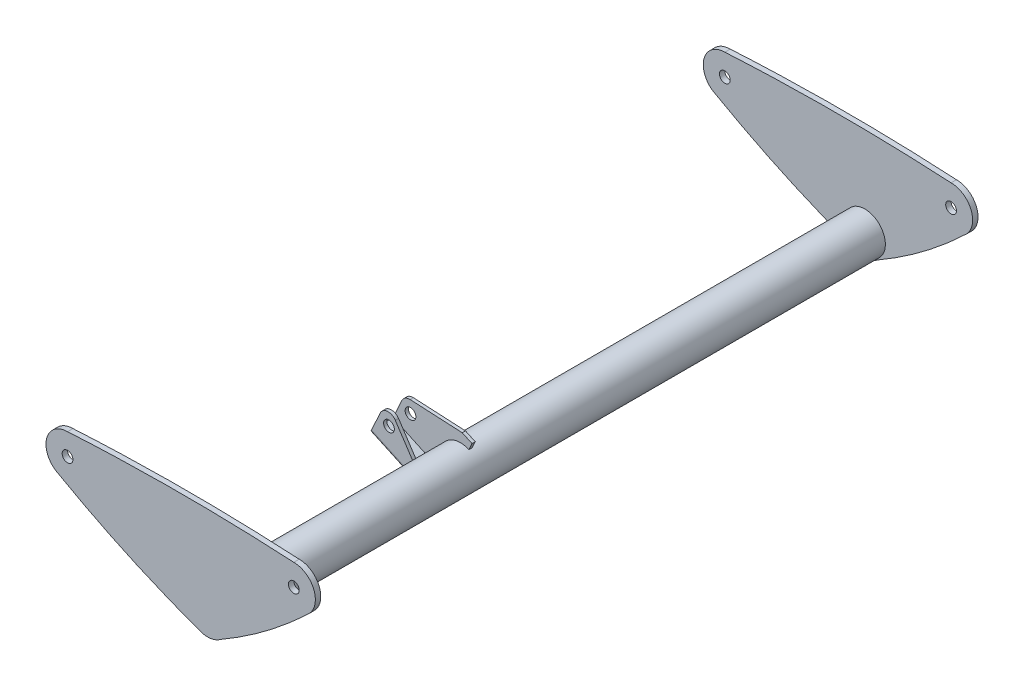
ISO-10303-21;
HEADER;
FILE_DESCRIPTION(('STEP AP214'),'2;1');
FILE_NAME('part.step','',(''),(''),'','','');
FILE_SCHEMA(('AUTOMOTIVE_DESIGN { 1 0 10303 214 1 1 1 1 }'));
ENDSEC;
DATA;
#1=APPLICATION_CONTEXT('core data for automotive mechanical design processes');
#2=APPLICATION_PROTOCOL_DEFINITION('international standard','automotive_design',2000,#1);
#3=PRODUCT_CONTEXT('',#1,'mechanical');
#4=PRODUCT('Part','Part','',(#3));
#5=PRODUCT_RELATED_PRODUCT_CATEGORY('part','',(#4));
#6=PRODUCT_DEFINITION_FORMATION('','',#4);
#7=PRODUCT_DEFINITION_CONTEXT('part definition',#1,'design');
#8=PRODUCT_DEFINITION('design','',#6,#7);
#9=PRODUCT_DEFINITION_SHAPE('','',#8);
#10=(LENGTH_UNIT() NAMED_UNIT(*) SI_UNIT(.MILLI.,.METRE.));
#11=(NAMED_UNIT(*) PLANE_ANGLE_UNIT() SI_UNIT($,.RADIAN.));
#12=(NAMED_UNIT(*) SI_UNIT($,.STERADIAN.) SOLID_ANGLE_UNIT());
#13=UNCERTAINTY_MEASURE_WITH_UNIT(LENGTH_MEASURE(1.E-05),#10,'distance_accuracy_value','');
#14=(GEOMETRIC_REPRESENTATION_CONTEXT(3) GLOBAL_UNCERTAINTY_ASSIGNED_CONTEXT((#13)) GLOBAL_UNIT_ASSIGNED_CONTEXT((#10,
#11,#12)) REPRESENTATION_CONTEXT('',''));
#15=CARTESIAN_POINT('',(0.,0.,0.));
#16=DIRECTION('',(0.,0.,1.));
#17=DIRECTION('',(1.,0.,0.));
#18=AXIS2_PLACEMENT_3D('',#15,#16,#17);
#19=CARTESIAN_POINT('',(122.037894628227,-77.2512283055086,-232.5));
#20=DIRECTION('',(0.419058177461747,0.907959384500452,0.));
#21=DIRECTION('',(-0.907959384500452,0.419058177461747,0.));
#22=AXIS2_PLACEMENT_3D('',#19,#20,#21);
#23=PLANE('',#22);
#24=DIRECTION('',(0.,0.,1.));
#25=VECTOR('',#24,1.);
#26=CARTESIAN_POINT('',(121.129935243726,-76.8321701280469,-212.5));
#27=LINE('',#26,#25);
#28=CARTESIAN_POINT('',(121.129935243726,-76.8321701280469,-232.5));
#29=VERTEX_POINT('',#28);
#30=CARTESIAN_POINT('',(121.129935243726,-76.8321701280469,-229.5));
#31=VERTEX_POINT('',#30);
#32=EDGE_CURVE('E63',#29,#31,#27,.T.);
#33=ORIENTED_EDGE('',*,*,#32,.F.);
#34=DIRECTION('',(-0.907959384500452,0.419058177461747,0.));
#35=VECTOR('',#34,1.);
#36=CARTESIAN_POINT('',(122.037894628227,-77.2512283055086,-232.5));
#37=LINE('',#36,#35);
#38=CARTESIAN_POINT('',(122.037894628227,-77.2512283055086,-232.5));
#39=VERTEX_POINT('',#38);
#40=EDGE_CURVE('E321',#39,#29,#37,.T.);
#41=ORIENTED_EDGE('',*,*,#40,.F.);
#42=DIRECTION('',(0.,0.,1.));
#43=VECTOR('',#42,1.);
#44=CARTESIAN_POINT('',(122.037894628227,-77.2512283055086,-232.5));
#45=LINE('',#44,#43);
#46=CARTESIAN_POINT('',(122.037894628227,-77.2512283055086,-229.5));
#47=VERTEX_POINT('',#46);
#48=EDGE_CURVE('E342',#39,#47,#45,.T.);
#49=ORIENTED_EDGE('',*,*,#48,.T.);
#50=DIRECTION('',(-0.907959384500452,0.419058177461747,0.));
#51=VECTOR('',#50,1.);
#52=CARTESIAN_POINT('',(122.037894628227,-77.2512283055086,-229.5));
#53=LINE('',#52,#51);
#54=EDGE_CURVE('E337',#47,#31,#53,.T.);
#55=ORIENTED_EDGE('',*,*,#54,.T.);
#56=EDGE_LOOP('',(#33,#41,#49,#55));
#57=FACE_BOUND('',#56,.T.);
#58=ADVANCED_FACE('F45',(#57),#23,.F.);
#59=CARTESIAN_POINT('',(122.037894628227,-77.2512283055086,-209.5));
#60=DIRECTION('',(-0.419058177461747,-0.907959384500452,0.));
#61=DIRECTION('',(0.907959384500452,-0.419058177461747,0.));
#62=AXIS2_PLACEMENT_3D('',#59,#60,#61);
#63=PLANE('',#62);
#64=DIRECTION('',(-0.907959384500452,0.419058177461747,0.));
#65=VECTOR('',#64,1.);
#66=CARTESIAN_POINT('',(122.037894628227,-77.2512283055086,-209.5));
#67=LINE('',#66,#65);
#68=CARTESIAN_POINT('',(122.037894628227,-77.2512283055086,-209.5));
#69=VERTEX_POINT('',#68);
#70=CARTESIAN_POINT('',(121.129935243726,-76.8321701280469,-209.5));
#71=VERTEX_POINT('',#70);
#72=EDGE_CURVE('E262',#69,#71,#67,.T.);
#73=ORIENTED_EDGE('',*,*,#72,.T.);
#74=CARTESIAN_POINT('',(121.129935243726,-76.8321701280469,-212.5));
#75=VERTEX_POINT('',#74);
#76=EDGE_CURVE('E236',#75,#71,#27,.T.);
#77=ORIENTED_EDGE('',*,*,#76,.F.);
#78=DIRECTION('',(-0.907959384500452,0.419058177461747,0.));
#79=VECTOR('',#78,1.);
#80=CARTESIAN_POINT('',(122.037894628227,-77.2512283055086,-212.5));
#81=LINE('',#80,#79);
#82=CARTESIAN_POINT('',(122.037894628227,-77.2512283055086,-212.5));
#83=VERTEX_POINT('',#82);
#84=EDGE_CURVE('E289',#83,#75,#81,.T.);
#85=ORIENTED_EDGE('',*,*,#84,.F.);
#86=DIRECTION('',(0.,0.,-1.));
#87=VECTOR('',#86,1.);
#88=CARTESIAN_POINT('',(122.037894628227,-77.2512283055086,-209.5));
#89=LINE('',#88,#87);
#90=EDGE_CURVE('E272',#69,#83,#89,.T.);
#91=ORIENTED_EDGE('',*,*,#90,.F.);
#92=EDGE_LOOP('',(#73,#77,#85,#91));
#93=FACE_BOUND('',#92,.T.);
#94=ADVANCED_FACE('F270',(#93),#63,.T.);
#95=CARTESIAN_POINT('',(130.,-60.,-605.));
#96=DIRECTION('',(0.,0.,1.));
#97=DIRECTION('',(1.,0.,0.));
#98=AXIS2_PLACEMENT_3D('',#95,#96,#97);
#99=CYLINDRICAL_SURFACE('',#98,19.);
#100=CARTESIAN_POINT('',(130.,-60.,0.));
#101=DIRECTION('',(0.,0.,1.));
#102=DIRECTION('',(1.,0.,0.));
#103=AXIS2_PLACEMENT_3D('',#100,#101,#102);
#104=CIRCLE('',#103,19.);
#105=CARTESIAN_POINT('',(149.,-60.,0.));
#106=VERTEX_POINT('',#105);
#107=EDGE_CURVE('E12',#106,#106,#104,.F.);
#108=ORIENTED_EDGE('',*,*,#107,.T.);
#109=EDGE_LOOP('',(#108));
#110=FACE_BOUND('',#109,.T.);
#111=CARTESIAN_POINT('',(130.,-60.,-605.));
#112=DIRECTION('',(0.,0.,-1.));
#113=DIRECTION('',(-1.,0.,0.));
#114=AXIS2_PLACEMENT_3D('',#111,#112,#113);
#115=CIRCLE('',#114,19.);
#116=CARTESIAN_POINT('',(111.,-60.,-605.));
#117=VERTEX_POINT('',#116);
#118=EDGE_CURVE('E639',#117,#117,#115,.T.);
#119=ORIENTED_EDGE('',*,*,#118,.F.);
#120=EDGE_LOOP('',(#119));
#121=FACE_BOUND('',#120,.T.);
#122=ORIENTED_EDGE('',*,*,#48,.F.);
#123=CARTESIAN_POINT('',(130.,-60.,-232.5));
#124=DIRECTION('',(0.,0.,1.));
#125=DIRECTION('',(-1.,0.,0.));
#126=AXIS2_PLACEMENT_3D('',#123,#124,#125);
#127=CIRCLE('',#126,19.);
#128=CARTESIAN_POINT('',(137.962105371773,-42.7487716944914,-232.5));
#129=VERTEX_POINT('',#128);
#130=EDGE_CURVE('E318',#129,#39,#127,.T.);
#131=ORIENTED_EDGE('',*,*,#130,.F.);
#132=DIRECTION('',(0.,0.,1.));
#133=VECTOR('',#132,1.);
#134=CARTESIAN_POINT('',(137.962105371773,-42.7487716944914,-232.5));
#135=LINE('',#134,#133);
#136=CARTESIAN_POINT('',(137.962105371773,-42.7487716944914,-229.5));
#137=VERTEX_POINT('',#136);
#138=EDGE_CURVE('E345',#129,#137,#135,.T.);
#139=ORIENTED_EDGE('',*,*,#138,.T.);
#140=CARTESIAN_POINT('',(130.,-60.,-229.5));
#141=DIRECTION('',(0.,0.,1.));
#142=DIRECTION('',(-1.,0.,0.));
#143=AXIS2_PLACEMENT_3D('',#140,#141,#142);
#144=CIRCLE('',#143,19.);
#145=EDGE_CURVE('E335',#137,#47,#144,.T.);
#146=ORIENTED_EDGE('',*,*,#145,.T.);
#147=EDGE_LOOP('',(#122,#131,#139,#146));
#148=FACE_BOUND('',#147,.T.);
#149=CARTESIAN_POINT('',(130.,-60.,-209.5));
#150=DIRECTION('',(0.,0.,1.));
#151=DIRECTION('',(-1.,0.,0.));
#152=AXIS2_PLACEMENT_3D('',#149,#150,#151);
#153=CIRCLE('',#152,19.);
#154=CARTESIAN_POINT('',(113.125592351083,-68.7323746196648,-209.5));
#155=VERTEX_POINT('',#154);
#156=EDGE_CURVE('E286',#155,#69,#153,.T.);
#157=ORIENTED_EDGE('',*,*,#156,.T.);
#158=ORIENTED_EDGE('',*,*,#90,.T.);
#159=CARTESIAN_POINT('',(130.,-60.,-212.5));
#160=DIRECTION('',(0.,0.,1.));
#161=DIRECTION('',(-1.,0.,0.));
#162=AXIS2_PLACEMENT_3D('',#159,#160,#161);
#163=CIRCLE('',#162,19.);
#164=CARTESIAN_POINT('',(113.125592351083,-68.7323746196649,-212.5));
#165=VERTEX_POINT('',#164);
#166=EDGE_CURVE('E273',#165,#83,#163,.T.);
#167=ORIENTED_EDGE('',*,*,#166,.F.);
#168=DIRECTION('',(0.,0.,-1.));
#169=VECTOR('',#168,1.);
#170=CARTESIAN_POINT('',(113.125592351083,-68.7323746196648,-209.5));
#171=LINE('',#170,#169);
#172=EDGE_CURVE('E301',#155,#165,#171,.T.);
#173=ORIENTED_EDGE('',*,*,#172,.F.);
#174=EDGE_LOOP('',(#157,#158,#167,#173));
#175=FACE_BOUND('',#174,.T.);
#176=ADVANCED_FACE('F397',(#110,#121,#148,#175),#99,.T.);
#177=CARTESIAN_POINT('',(105.,23.,0.));
#178=DIRECTION('',(0.,0.,1.));
#179=DIRECTION('',(1.,0.,0.));
#180=AXIS2_PLACEMENT_3D('',#177,#178,#179);
#181=PLANE('',#180);
#182=CARTESIAN_POINT('',(0.,0.,0.));
#183=DIRECTION('',(0.,0.,1.));
#184=DIRECTION('',(1.,0.,0.));
#185=AXIS2_PLACEMENT_3D('',#182,#183,#184);
#186=CIRCLE('',#185,5.);
#187=CARTESIAN_POINT('',(5.,0.,0.));
#188=VERTEX_POINT('',#187);
#189=EDGE_CURVE('E646',#188,#188,#186,.T.);
#190=ORIENTED_EDGE('',*,*,#189,.T.);
#191=EDGE_LOOP('',(#190));
#192=FACE_BOUND('',#191,.T.);
#193=CARTESIAN_POINT('',(210.,20.,0.));
#194=CARTESIAN_POINT('',(105.,26.,0.));
#195=CARTESIAN_POINT('',(0.,20.,0.));
#196=B_SPLINE_CURVE_WITH_KNOTS('',2,(#193,#194,#195),.UNSPECIFIED.,.F.,.F.,(3,3),(0.,1.),.UNSPECIFIED.);
#197=CARTESIAN_POINT('',(210.,20.,0.));
#198=VERTEX_POINT('',#197);
#199=CARTESIAN_POINT('',(0.,20.,0.));
#200=VERTEX_POINT('',#199);
#201=EDGE_CURVE('E442',#198,#200,#196,.T.);
#202=ORIENTED_EDGE('',*,*,#201,.F.);
#203=CARTESIAN_POINT('',(210.,0.,0.));
#204=DIRECTION('',(0.,0.,1.));
#205=DIRECTION('',(1.,0.,0.));
#206=AXIS2_PLACEMENT_3D('',#203,#204,#205);
#207=CIRCLE('',#206,20.);
#208=CARTESIAN_POINT('',(222.,-16.,0.));
#209=VERTEX_POINT('',#208);
#210=EDGE_CURVE('E466',#209,#198,#207,.T.);
#211=ORIENTED_EDGE('',*,*,#210,.F.);
#212=CARTESIAN_POINT('',(142.,-76.,0.));
#213=CARTESIAN_POINT('',(185.6,-50.8,0.));
#214=CARTESIAN_POINT('',(222.,-16.,0.));
#215=B_SPLINE_CURVE_WITH_KNOTS('',2,(#212,#213,#214),.UNSPECIFIED.,.F.,.F.,(3,3),(0.,1.),.UNSPECIFIED.);
#216=CARTESIAN_POINT('',(142.,-76.,0.));
#217=VERTEX_POINT('',#216);
#218=EDGE_CURVE('E462',#217,#209,#215,.T.);
#219=ORIENTED_EDGE('',*,*,#218,.F.);
#220=CARTESIAN_POINT('',(130.,-60.,0.));
#221=DIRECTION('',(0.,0.,1.));
#222=DIRECTION('',(1.,0.,0.));
#223=AXIS2_PLACEMENT_3D('',#220,#221,#222);
#224=CIRCLE('',#223,20.);
#225=CARTESIAN_POINT('',(121.618836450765,-78.159187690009,0.));
#226=VERTEX_POINT('',#225);
#227=EDGE_CURVE('E457',#226,#217,#224,.T.);
#228=ORIENTED_EDGE('',*,*,#227,.F.);
#229=CARTESIAN_POINT('',(-8.38116354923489,-18.159187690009,0.));
#230=CARTESIAN_POINT('',(54.1044873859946,-53.6069439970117,0.));
#231=CARTESIAN_POINT('',(121.618836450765,-78.159187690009,0.));
#232=B_SPLINE_CURVE_WITH_KNOTS('',2,(#229,#230,#231),.UNSPECIFIED.,.F.,.F.,(3,3),(0.,1.),.UNSPECIFIED.);
#233=CARTESIAN_POINT('',(-8.38116354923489,-18.159187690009,0.));
#234=VERTEX_POINT('',#233);
#235=EDGE_CURVE('E453',#234,#226,#232,.T.);
#236=ORIENTED_EDGE('',*,*,#235,.F.);
#237=CARTESIAN_POINT('',(0.,0.,0.));
#238=DIRECTION('',(0.,0.,1.));
#239=DIRECTION('',(1.,0.,0.));
#240=AXIS2_PLACEMENT_3D('',#237,#238,#239);
#241=CIRCLE('',#240,20.);
#242=EDGE_CURVE('E447',#200,#234,#241,.T.);
#243=ORIENTED_EDGE('',*,*,#242,.F.);
#244=EDGE_LOOP('',(#202,#211,#219,#228,#236,#243));
#245=FACE_BOUND('',#244,.T.);
#246=CARTESIAN_POINT('',(210.,0.,0.));
#247=DIRECTION('',(0.,0.,1.));
#248=DIRECTION('',(1.,0.,0.));
#249=AXIS2_PLACEMENT_3D('',#246,#247,#248);
#250=CIRCLE('',#249,5.00000000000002);
#251=CARTESIAN_POINT('',(215.,0.,0.));
#252=VERTEX_POINT('',#251);
#253=EDGE_CURVE('E642',#252,#252,#250,.T.);
#254=ORIENTED_EDGE('',*,*,#253,.T.);
#255=EDGE_LOOP('',(#254));
#256=FACE_BOUND('',#255,.T.);
#257=ORIENTED_EDGE('',*,*,#107,.F.);
#258=EDGE_LOOP('',(#257));
#259=FACE_BOUND('',#258,.T.);
#260=ADVANCED_FACE('F400',(#192,#245,#256,#259),#181,.F.);
#261=CARTESIAN_POINT('',(105.,23.,5.));
#262=DIRECTION('',(0.,0.,1.));
#263=DIRECTION('',(1.,0.,0.));
#264=AXIS2_PLACEMENT_3D('',#261,#262,#263);
#265=PLANE('',#264);
#266=CARTESIAN_POINT('',(0.,0.,5.));
#267=DIRECTION('',(0.,0.,1.));
#268=DIRECTION('',(1.,0.,0.));
#269=AXIS2_PLACEMENT_3D('',#266,#267,#268);
#270=CIRCLE('',#269,5.);
#271=CARTESIAN_POINT('',(5.,0.,5.));
#272=VERTEX_POINT('',#271);
#273=EDGE_CURVE('E448',#272,#272,#270,.T.);
#274=ORIENTED_EDGE('',*,*,#273,.F.);
#275=EDGE_LOOP('',(#274));
#276=FACE_BOUND('',#275,.T.);
#277=CARTESIAN_POINT('',(210.,20.,5.));
#278=CARTESIAN_POINT('',(105.,26.,5.));
#279=CARTESIAN_POINT('',(0.,20.,5.));
#280=B_SPLINE_CURVE_WITH_KNOTS('',2,(#277,#278,#279),.UNSPECIFIED.,.F.,.F.,(3,3),(0.,1.),.UNSPECIFIED.);
#281=CARTESIAN_POINT('',(210.,20.,5.));
#282=VERTEX_POINT('',#281);
#283=CARTESIAN_POINT('',(0.,20.,5.));
#284=VERTEX_POINT('',#283);
#285=EDGE_CURVE('E471',#282,#284,#280,.T.);
#286=ORIENTED_EDGE('',*,*,#285,.T.);
#287=CARTESIAN_POINT('',(0.,0.,5.));
#288=DIRECTION('',(0.,0.,1.));
#289=DIRECTION('',(1.,0.,0.));
#290=AXIS2_PLACEMENT_3D('',#287,#288,#289);
#291=CIRCLE('',#290,20.);
#292=CARTESIAN_POINT('',(-8.38116354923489,-18.159187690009,5.));
#293=VERTEX_POINT('',#292);
#294=EDGE_CURVE('E491',#284,#293,#291,.T.);
#295=ORIENTED_EDGE('',*,*,#294,.T.);
#296=CARTESIAN_POINT('',(-8.38116354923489,-18.159187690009,5.));
#297=CARTESIAN_POINT('',(54.1044873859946,-53.6069439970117,5.));
#298=CARTESIAN_POINT('',(121.618836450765,-78.159187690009,5.));
#299=B_SPLINE_CURVE_WITH_KNOTS('',2,(#296,#297,#298),.UNSPECIFIED.,.F.,.F.,(3,3),(0.,1.),.UNSPECIFIED.);
#300=CARTESIAN_POINT('',(121.618836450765,-78.159187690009,5.));
#301=VERTEX_POINT('',#300);
#302=EDGE_CURVE('E512',#293,#301,#299,.T.);
#303=ORIENTED_EDGE('',*,*,#302,.T.);
#304=CARTESIAN_POINT('',(130.,-60.,5.));
#305=DIRECTION('',(0.,0.,1.));
#306=DIRECTION('',(1.,0.,0.));
#307=AXIS2_PLACEMENT_3D('',#304,#305,#306);
#308=CIRCLE('',#307,20.);
#309=CARTESIAN_POINT('',(142.,-76.,5.));
#310=VERTEX_POINT('',#309);
#311=EDGE_CURVE('E435',#301,#310,#308,.T.);
#312=ORIENTED_EDGE('',*,*,#311,.T.);
#313=CARTESIAN_POINT('',(142.,-76.,5.));
#314=CARTESIAN_POINT('',(185.6,-50.8,5.));
#315=CARTESIAN_POINT('',(222.,-16.,5.));
#316=B_SPLINE_CURVE_WITH_KNOTS('',2,(#313,#314,#315),.UNSPECIFIED.,.F.,.F.,(3,3),(0.,1.),.UNSPECIFIED.);
#317=CARTESIAN_POINT('',(222.,-16.,5.));
#318=VERTEX_POINT('',#317);
#319=EDGE_CURVE('E428',#310,#318,#316,.T.);
#320=ORIENTED_EDGE('',*,*,#319,.T.);
#321=CARTESIAN_POINT('',(210.,0.,5.));
#322=DIRECTION('',(0.,0.,1.));
#323=DIRECTION('',(1.,0.,0.));
#324=AXIS2_PLACEMENT_3D('',#321,#322,#323);
#325=CIRCLE('',#324,20.);
#326=EDGE_CURVE('E434',#318,#282,#325,.T.);
#327=ORIENTED_EDGE('',*,*,#326,.T.);
#328=EDGE_LOOP('',(#286,#295,#303,#312,#320,#327));
#329=FACE_BOUND('',#328,.T.);
#330=CARTESIAN_POINT('',(210.,0.,5.));
#331=DIRECTION('',(0.,0.,1.));
#332=DIRECTION('',(1.,0.,0.));
#333=AXIS2_PLACEMENT_3D('',#330,#331,#332);
#334=CIRCLE('',#333,5.00000000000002);
#335=CARTESIAN_POINT('',(215.,0.,5.));
#336=VERTEX_POINT('',#335);
#337=EDGE_CURVE('E643',#336,#336,#334,.T.);
#338=ORIENTED_EDGE('',*,*,#337,.F.);
#339=EDGE_LOOP('',(#338));
#340=FACE_BOUND('',#339,.T.);
#341=ADVANCED_FACE('F411',(#276,#329,#340),#265,.T.);
#342=DIRECTION('',(0.,0.,-1.));
#343=VECTOR('',#342,1.);
#344=SURFACE_OF_LINEAR_EXTRUSION('',#280,#343);
#345=ORIENTED_EDGE('',*,*,#201,.T.);
#346=DIRECTION('',(0.,0.,-1.));
#347=VECTOR('',#346,1.);
#348=CARTESIAN_POINT('',(0.,20.,5.));
#349=LINE('',#348,#347);
#350=EDGE_CURVE('E56',#284,#200,#349,.T.);
#351=ORIENTED_EDGE('',*,*,#350,.F.);
#352=ORIENTED_EDGE('',*,*,#285,.F.);
#353=DIRECTION('',(0.,0.,-1.));
#354=VECTOR('',#353,1.);
#355=CARTESIAN_POINT('',(210.,20.,5.));
#356=LINE('',#355,#354);
#357=EDGE_CURVE('E441',#282,#198,#356,.T.);
#358=ORIENTED_EDGE('',*,*,#357,.T.);
#359=EDGE_LOOP('',(#345,#351,#352,#358));
#360=FACE_BOUND('',#359,.T.);
#361=ADVANCED_FACE('F47',(#360),#344,.F.);
#362=CARTESIAN_POINT('',(0.,0.,5.));
#363=DIRECTION('',(0.,0.,-1.));
#364=DIRECTION('',(-1.,0.,0.));
#365=AXIS2_PLACEMENT_3D('',#362,#363,#364);
#366=CYLINDRICAL_SURFACE('',#365,20.);
#367=ORIENTED_EDGE('',*,*,#242,.T.);
#368=DIRECTION('',(0.,0.,-1.));
#369=VECTOR('',#368,1.);
#370=CARTESIAN_POINT('',(-8.38116354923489,-18.159187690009,5.));
#371=LINE('',#370,#369);
#372=EDGE_CURVE('E483',#293,#234,#371,.T.);
#373=ORIENTED_EDGE('',*,*,#372,.F.);
#374=ORIENTED_EDGE('',*,*,#294,.F.);
#375=ORIENTED_EDGE('',*,*,#350,.T.);
#376=EDGE_LOOP('',(#367,#373,#374,#375));
#377=FACE_BOUND('',#376,.T.);
#378=ADVANCED_FACE('F489',(#377),#366,.T.);
#379=DIRECTION('',(0.,0.,-1.));
#380=VECTOR('',#379,1.);
#381=SURFACE_OF_LINEAR_EXTRUSION('',#299,#380);
#382=ORIENTED_EDGE('',*,*,#235,.T.);
#383=DIRECTION('',(0.,0.,-1.));
#384=VECTOR('',#383,1.);
#385=CARTESIAN_POINT('',(121.618836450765,-78.159187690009,5.));
#386=LINE('',#385,#384);
#387=EDGE_CURVE('E480',#301,#226,#386,.T.);
#388=ORIENTED_EDGE('',*,*,#387,.F.);
#389=ORIENTED_EDGE('',*,*,#302,.F.);
#390=ORIENTED_EDGE('',*,*,#372,.T.);
#391=EDGE_LOOP('',(#382,#388,#389,#390));
#392=FACE_BOUND('',#391,.T.);
#393=ADVANCED_FACE('F505',(#392),#381,.F.);
#394=CARTESIAN_POINT('',(130.,-60.,5.));
#395=DIRECTION('',(0.,0.,-1.));
#396=DIRECTION('',(-1.,0.,0.));
#397=AXIS2_PLACEMENT_3D('',#394,#395,#396);
#398=CYLINDRICAL_SURFACE('',#397,20.);
#399=ORIENTED_EDGE('',*,*,#227,.T.);
#400=DIRECTION('',(0.,0.,-1.));
#401=VECTOR('',#400,1.);
#402=CARTESIAN_POINT('',(142.,-76.,5.));
#403=LINE('',#402,#401);
#404=EDGE_CURVE('E477',#310,#217,#403,.T.);
#405=ORIENTED_EDGE('',*,*,#404,.F.);
#406=ORIENTED_EDGE('',*,*,#311,.F.);
#407=ORIENTED_EDGE('',*,*,#387,.T.);
#408=EDGE_LOOP('',(#399,#405,#406,#407));
#409=FACE_BOUND('',#408,.T.);
#410=ADVANCED_FACE('F425',(#409),#398,.T.);
#411=DIRECTION('',(0.,0.,-1.));
#412=VECTOR('',#411,1.);
#413=SURFACE_OF_LINEAR_EXTRUSION('',#316,#412);
#414=ORIENTED_EDGE('',*,*,#218,.T.);
#415=DIRECTION('',(0.,0.,-1.));
#416=VECTOR('',#415,1.);
#417=CARTESIAN_POINT('',(222.,-16.,5.));
#418=LINE('',#417,#416);
#419=EDGE_CURVE('E474',#318,#209,#418,.T.);
#420=ORIENTED_EDGE('',*,*,#419,.F.);
#421=ORIENTED_EDGE('',*,*,#319,.F.);
#422=ORIENTED_EDGE('',*,*,#404,.T.);
#423=EDGE_LOOP('',(#414,#420,#421,#422));
#424=FACE_BOUND('',#423,.T.);
#425=ADVANCED_FACE('F420',(#424),#413,.F.);
#426=CARTESIAN_POINT('',(210.,0.,5.));
#427=DIRECTION('',(0.,0.,-1.));
#428=DIRECTION('',(-1.,0.,0.));
#429=AXIS2_PLACEMENT_3D('',#426,#427,#428);
#430=CYLINDRICAL_SURFACE('',#429,20.);
#431=ORIENTED_EDGE('',*,*,#210,.T.);
#432=ORIENTED_EDGE('',*,*,#357,.F.);
#433=ORIENTED_EDGE('',*,*,#326,.F.);
#434=ORIENTED_EDGE('',*,*,#419,.T.);
#435=EDGE_LOOP('',(#431,#432,#433,#434));
#436=FACE_BOUND('',#435,.T.);
#437=ADVANCED_FACE('F409',(#436),#430,.T.);
#438=CARTESIAN_POINT('',(0.,0.,5.));
#439=DIRECTION('',(0.,0.,-1.));
#440=DIRECTION('',(-1.,0.,0.));
#441=AXIS2_PLACEMENT_3D('',#438,#439,#440);
#442=CYLINDRICAL_SURFACE('',#441,5.);
#443=ORIENTED_EDGE('',*,*,#273,.T.);
#444=EDGE_LOOP('',(#443));
#445=FACE_BOUND('',#444,.T.);
#446=ORIENTED_EDGE('',*,*,#189,.F.);
#447=EDGE_LOOP('',(#446));
#448=FACE_BOUND('',#447,.T.);
#449=ADVANCED_FACE('F405',(#445,#448),#442,.F.);
#450=CARTESIAN_POINT('',(210.,0.,5.));
#451=DIRECTION('',(0.,0.,-1.));
#452=DIRECTION('',(-1.,0.,0.));
#453=AXIS2_PLACEMENT_3D('',#450,#451,#452);
#454=CYLINDRICAL_SURFACE('',#453,5.00000000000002);
#455=ORIENTED_EDGE('',*,*,#337,.T.);
#456=EDGE_LOOP('',(#455));
#457=FACE_BOUND('',#456,.T.);
#458=ORIENTED_EDGE('',*,*,#253,.F.);
#459=EDGE_LOOP('',(#458));
#460=FACE_BOUND('',#459,.T.);
#461=ADVANCED_FACE('F402',(#457,#460),#454,.F.);
#462=CARTESIAN_POINT('',(105.,23.,-605.));
#463=DIRECTION('',(0.,0.,-1.));
#464=DIRECTION('',(1.,0.,0.));
#465=AXIS2_PLACEMENT_3D('',#462,#463,#464);
#466=PLANE('',#465);
#467=CARTESIAN_POINT('',(210.,0.,-605.));
#468=DIRECTION('',(0.,0.,1.));
#469=DIRECTION('',(1.,0.,0.));
#470=AXIS2_PLACEMENT_3D('',#467,#468,#469);
#471=CIRCLE('',#470,5.00000000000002);
#472=CARTESIAN_POINT('',(215.,0.,-605.));
#473=VERTEX_POINT('',#472);
#474=EDGE_CURVE('E356',#473,#473,#471,.T.);
#475=ORIENTED_EDGE('',*,*,#474,.F.);
#476=EDGE_LOOP('',(#475));
#477=FACE_BOUND('',#476,.T.);
#478=CARTESIAN_POINT('',(0.,0.,-605.));
#479=DIRECTION('',(0.,0.,1.));
#480=DIRECTION('',(1.,0.,0.));
#481=AXIS2_PLACEMENT_3D('',#478,#479,#480);
#482=CIRCLE('',#481,5.);
#483=CARTESIAN_POINT('',(5.,0.,-605.));
#484=VERTEX_POINT('',#483);
#485=EDGE_CURVE('E360',#484,#484,#482,.T.);
#486=ORIENTED_EDGE('',*,*,#485,.F.);
#487=EDGE_LOOP('',(#486));
#488=FACE_BOUND('',#487,.T.);
#489=CARTESIAN_POINT('',(210.,20.,-605.));
#490=CARTESIAN_POINT('',(105.,26.,-605.));
#491=CARTESIAN_POINT('',(0.,20.,-605.));
#492=B_SPLINE_CURVE_WITH_KNOTS('',2,(#489,#490,#491),.UNSPECIFIED.,.F.,.F.,(3,3),(0.,1.),.UNSPECIFIED.);
#493=CARTESIAN_POINT('',(210.,20.,-605.));
#494=VERTEX_POINT('',#493);
#495=CARTESIAN_POINT('',(0.,20.,-605.));
#496=VERTEX_POINT('',#495);
#497=EDGE_CURVE('E366',#494,#496,#492,.T.);
#498=ORIENTED_EDGE('',*,*,#497,.T.);
#499=CARTESIAN_POINT('',(0.,0.,-605.));
#500=DIRECTION('',(0.,0.,1.));
#501=DIRECTION('',(1.,0.,0.));
#502=AXIS2_PLACEMENT_3D('',#499,#500,#501);
#503=CIRCLE('',#502,20.);
#504=CARTESIAN_POINT('',(-8.38116354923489,-18.159187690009,-605.));
#505=VERTEX_POINT('',#504);
#506=EDGE_CURVE('E376',#496,#505,#503,.T.);
#507=ORIENTED_EDGE('',*,*,#506,.T.);
#508=CARTESIAN_POINT('',(-8.38116354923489,-18.159187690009,-605.));
#509=CARTESIAN_POINT('',(54.1044873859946,-53.6069439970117,-605.));
#510=CARTESIAN_POINT('',(121.618836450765,-78.159187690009,-605.));
#511=B_SPLINE_CURVE_WITH_KNOTS('',2,(#508,#509,#510),.UNSPECIFIED.,.F.,.F.,(3,3),(0.,1.),.UNSPECIFIED.);
#512=CARTESIAN_POINT('',(121.618836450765,-78.159187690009,-605.));
#513=VERTEX_POINT('',#512);
#514=EDGE_CURVE('E612',#505,#513,#511,.T.);
#515=ORIENTED_EDGE('',*,*,#514,.T.);
#516=CARTESIAN_POINT('',(130.,-60.,-605.));
#517=DIRECTION('',(0.,0.,1.));
#518=DIRECTION('',(1.,0.,0.));
#519=AXIS2_PLACEMENT_3D('',#516,#517,#518);
#520=CIRCLE('',#519,20.);
#521=CARTESIAN_POINT('',(142.,-76.,-605.));
#522=VERTEX_POINT('',#521);
#523=EDGE_CURVE('E606',#513,#522,#520,.T.);
#524=ORIENTED_EDGE('',*,*,#523,.T.);
#525=CARTESIAN_POINT('',(142.,-76.,-605.));
#526=CARTESIAN_POINT('',(185.6,-50.8,-605.));
#527=CARTESIAN_POINT('',(222.,-16.,-605.));
#528=B_SPLINE_CURVE_WITH_KNOTS('',2,(#525,#526,#527),.UNSPECIFIED.,.F.,.F.,(3,3),(0.,1.),.UNSPECIFIED.);
#529=CARTESIAN_POINT('',(222.,-16.,-605.));
#530=VERTEX_POINT('',#529);
#531=EDGE_CURVE('E601',#522,#530,#528,.T.);
#532=ORIENTED_EDGE('',*,*,#531,.T.);
#533=CARTESIAN_POINT('',(210.,0.,-605.));
#534=DIRECTION('',(0.,0.,1.));
#535=DIRECTION('',(1.,0.,0.));
#536=AXIS2_PLACEMENT_3D('',#533,#534,#535);
#537=CIRCLE('',#536,20.);
#538=EDGE_CURVE('E595',#530,#494,#537,.T.);
#539=ORIENTED_EDGE('',*,*,#538,.T.);
#540=EDGE_LOOP('',(#498,#507,#515,#524,#532,#539));
#541=FACE_BOUND('',#540,.T.);
#542=ORIENTED_EDGE('',*,*,#118,.T.);
#543=EDGE_LOOP('',(#542));
#544=FACE_BOUND('',#543,.T.);
#545=ADVANCED_FACE('F387',(#477,#488,#541,#544),#466,.F.);
#546=CARTESIAN_POINT('',(210.,20.,-610.));
#547=CARTESIAN_POINT('',(105.,26.,-610.));
#548=CARTESIAN_POINT('',(0.,20.,-610.));
#549=B_SPLINE_CURVE_WITH_KNOTS('',2,(#546,#547,#548),.UNSPECIFIED.,.F.,.F.,(3,3),(0.,1.),.UNSPECIFIED.);
#550=DIRECTION('',(0.,0.,1.));
#551=VECTOR('',#550,1.);
#552=SURFACE_OF_LINEAR_EXTRUSION('',#549,#551);
#553=ORIENTED_EDGE('',*,*,#497,.F.);
#554=DIRECTION('',(0.,0.,1.));
#555=VECTOR('',#554,1.);
#556=CARTESIAN_POINT('',(210.,20.,-610.));
#557=LINE('',#556,#555);
#558=CARTESIAN_POINT('',(210.,20.,-610.));
#559=VERTEX_POINT('',#558);
#560=EDGE_CURVE('E631',#559,#494,#557,.T.);
#561=ORIENTED_EDGE('',*,*,#560,.F.);
#562=CARTESIAN_POINT('',(0.,20.,-610.));
#563=VERTEX_POINT('',#562);
#564=EDGE_CURVE('E369',#559,#563,#549,.T.);
#565=ORIENTED_EDGE('',*,*,#564,.T.);
#566=DIRECTION('',(0.,0.,1.));
#567=VECTOR('',#566,1.);
#568=CARTESIAN_POINT('',(0.,20.,-610.));
#569=LINE('',#568,#567);
#570=EDGE_CURVE('E590',#563,#496,#569,.T.);
#571=ORIENTED_EDGE('',*,*,#570,.T.);
#572=EDGE_LOOP('',(#553,#561,#565,#571));
#573=FACE_BOUND('',#572,.T.);
#574=ADVANCED_FACE('F382',(#573),#552,.T.);
#575=CARTESIAN_POINT('',(210.,0.,-610.));
#576=DIRECTION('',(0.,0.,1.));
#577=DIRECTION('',(1.,0.,0.));
#578=AXIS2_PLACEMENT_3D('',#575,#576,#577);
#579=CYLINDRICAL_SURFACE('',#578,20.);
#580=ORIENTED_EDGE('',*,*,#538,.F.);
#581=DIRECTION('',(0.,0.,1.));
#582=VECTOR('',#581,1.);
#583=CARTESIAN_POINT('',(222.,-16.,-610.));
#584=LINE('',#583,#582);
#585=CARTESIAN_POINT('',(222.,-16.,-610.));
#586=VERTEX_POINT('',#585);
#587=EDGE_CURVE('E629',#586,#530,#584,.T.);
#588=ORIENTED_EDGE('',*,*,#587,.F.);
#589=CARTESIAN_POINT('',(210.,0.,-610.));
#590=DIRECTION('',(0.,0.,1.));
#591=DIRECTION('',(1.,0.,0.));
#592=AXIS2_PLACEMENT_3D('',#589,#590,#591);
#593=CIRCLE('',#592,20.);
#594=EDGE_CURVE('E375',#586,#559,#593,.T.);
#595=ORIENTED_EDGE('',*,*,#594,.T.);
#596=ORIENTED_EDGE('',*,*,#560,.T.);
#597=EDGE_LOOP('',(#580,#588,#595,#596));
#598=FACE_BOUND('',#597,.T.);
#599=ADVANCED_FACE('F386',(#598),#579,.T.);
#600=CARTESIAN_POINT('',(142.,-76.,-610.));
#601=CARTESIAN_POINT('',(185.6,-50.8,-610.));
#602=CARTESIAN_POINT('',(222.,-16.,-610.));
#603=B_SPLINE_CURVE_WITH_KNOTS('',2,(#600,#601,#602),.UNSPECIFIED.,.F.,.F.,(3,3),(0.,1.),.UNSPECIFIED.);
#604=DIRECTION('',(0.,0.,1.));
#605=VECTOR('',#604,1.);
#606=SURFACE_OF_LINEAR_EXTRUSION('',#603,#605);
#607=ORIENTED_EDGE('',*,*,#531,.F.);
#608=DIRECTION('',(0.,0.,1.));
#609=VECTOR('',#608,1.);
#610=CARTESIAN_POINT('',(142.,-76.,-610.));
#611=LINE('',#610,#609);
#612=CARTESIAN_POINT('',(142.,-76.,-610.));
#613=VERTEX_POINT('',#612);
#614=EDGE_CURVE('E627',#613,#522,#611,.T.);
#615=ORIENTED_EDGE('',*,*,#614,.F.);
#616=EDGE_CURVE('E1074',#613,#586,#603,.T.);
#617=ORIENTED_EDGE('',*,*,#616,.T.);
#618=ORIENTED_EDGE('',*,*,#587,.T.);
#619=EDGE_LOOP('',(#607,#615,#617,#618));
#620=FACE_BOUND('',#619,.T.);
#621=ADVANCED_FACE('F1001',(#620),#606,.T.);
#622=CARTESIAN_POINT('',(130.,-60.,-610.));
#623=DIRECTION('',(0.,0.,1.));
#624=DIRECTION('',(1.,0.,0.));
#625=AXIS2_PLACEMENT_3D('',#622,#623,#624);
#626=CYLINDRICAL_SURFACE('',#625,20.);
#627=ORIENTED_EDGE('',*,*,#523,.F.);
#628=DIRECTION('',(0.,0.,1.));
#629=VECTOR('',#628,1.);
#630=CARTESIAN_POINT('',(121.618836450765,-78.159187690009,-610.));
#631=LINE('',#630,#629);
#632=CARTESIAN_POINT('',(121.618836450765,-78.159187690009,-610.));
#633=VERTEX_POINT('',#632);
#634=EDGE_CURVE('E625',#633,#513,#631,.T.);
#635=ORIENTED_EDGE('',*,*,#634,.F.);
#636=CARTESIAN_POINT('',(130.,-60.,-610.));
#637=DIRECTION('',(0.,0.,1.));
#638=DIRECTION('',(1.,0.,0.));
#639=AXIS2_PLACEMENT_3D('',#636,#637,#638);
#640=CIRCLE('',#639,20.);
#641=EDGE_CURVE('E584',#633,#613,#640,.T.);
#642=ORIENTED_EDGE('',*,*,#641,.T.);
#643=ORIENTED_EDGE('',*,*,#614,.T.);
#644=EDGE_LOOP('',(#627,#635,#642,#643));
#645=FACE_BOUND('',#644,.T.);
#646=ADVANCED_FACE('F574',(#645),#626,.T.);
#647=CARTESIAN_POINT('',(-8.38116354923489,-18.159187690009,-610.));
#648=CARTESIAN_POINT('',(54.1044873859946,-53.6069439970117,-610.));
#649=CARTESIAN_POINT('',(121.618836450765,-78.159187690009,-610.));
#650=B_SPLINE_CURVE_WITH_KNOTS('',2,(#647,#648,#649),.UNSPECIFIED.,.F.,.F.,(3,3),(0.,1.),.UNSPECIFIED.);
#651=DIRECTION('',(0.,0.,1.));
#652=VECTOR('',#651,1.);
#653=SURFACE_OF_LINEAR_EXTRUSION('',#650,#652);
#654=ORIENTED_EDGE('',*,*,#514,.F.);
#655=DIRECTION('',(0.,0.,1.));
#656=VECTOR('',#655,1.);
#657=CARTESIAN_POINT('',(-8.38116354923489,-18.159187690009,-610.));
#658=LINE('',#657,#656);
#659=CARTESIAN_POINT('',(-8.38116354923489,-18.159187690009,-610.));
#660=VERTEX_POINT('',#659);
#661=EDGE_CURVE('E623',#660,#505,#658,.T.);
#662=ORIENTED_EDGE('',*,*,#661,.F.);
#663=EDGE_CURVE('E576',#660,#633,#650,.T.);
#664=ORIENTED_EDGE('',*,*,#663,.T.);
#665=ORIENTED_EDGE('',*,*,#634,.T.);
#666=EDGE_LOOP('',(#654,#662,#664,#665));
#667=FACE_BOUND('',#666,.T.);
#668=ADVANCED_FACE('F569',(#667),#653,.T.);
#669=CARTESIAN_POINT('',(0.,0.,-610.));
#670=DIRECTION('',(0.,0.,1.));
#671=DIRECTION('',(1.,0.,0.));
#672=AXIS2_PLACEMENT_3D('',#669,#670,#671);
#673=CYLINDRICAL_SURFACE('',#672,20.);
#674=ORIENTED_EDGE('',*,*,#506,.F.);
#675=ORIENTED_EDGE('',*,*,#570,.F.);
#676=CARTESIAN_POINT('',(0.,0.,-610.));
#677=DIRECTION('',(0.,0.,1.));
#678=DIRECTION('',(1.,0.,0.));
#679=AXIS2_PLACEMENT_3D('',#676,#677,#678);
#680=CIRCLE('',#679,20.);
#681=EDGE_CURVE('E583',#563,#660,#680,.T.);
#682=ORIENTED_EDGE('',*,*,#681,.T.);
#683=ORIENTED_EDGE('',*,*,#661,.T.);
#684=EDGE_LOOP('',(#674,#675,#682,#683));
#685=FACE_BOUND('',#684,.T.);
#686=ADVANCED_FACE('F562',(#685),#673,.T.);
#687=CARTESIAN_POINT('',(105.,23.,-610.));
#688=DIRECTION('',(0.,0.,-1.));
#689=DIRECTION('',(1.,0.,0.));
#690=AXIS2_PLACEMENT_3D('',#687,#688,#689);
#691=PLANE('',#690);
#692=CARTESIAN_POINT('',(210.,0.,-610.));
#693=DIRECTION('',(0.,0.,1.));
#694=DIRECTION('',(1.,0.,0.));
#695=AXIS2_PLACEMENT_3D('',#692,#693,#694);
#696=CIRCLE('',#695,5.00000000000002);
#697=CARTESIAN_POINT('',(215.,0.,-610.));
#698=VERTEX_POINT('',#697);
#699=EDGE_CURVE('E357',#698,#698,#696,.T.);
#700=ORIENTED_EDGE('',*,*,#699,.T.);
#701=EDGE_LOOP('',(#700));
#702=FACE_BOUND('',#701,.T.);
#703=CARTESIAN_POINT('',(0.,0.,-610.));
#704=DIRECTION('',(0.,0.,1.));
#705=DIRECTION('',(1.,0.,0.));
#706=AXIS2_PLACEMENT_3D('',#703,#704,#705);
#707=CIRCLE('',#706,5.);
#708=CARTESIAN_POINT('',(5.,0.,-610.));
#709=VERTEX_POINT('',#708);
#710=EDGE_CURVE('E363',#709,#709,#707,.T.);
#711=ORIENTED_EDGE('',*,*,#710,.T.);
#712=EDGE_LOOP('',(#711));
#713=FACE_BOUND('',#712,.T.);
#714=ORIENTED_EDGE('',*,*,#564,.F.);
#715=ORIENTED_EDGE('',*,*,#594,.F.);
#716=ORIENTED_EDGE('',*,*,#616,.F.);
#717=ORIENTED_EDGE('',*,*,#641,.F.);
#718=ORIENTED_EDGE('',*,*,#663,.F.);
#719=ORIENTED_EDGE('',*,*,#681,.F.);
#720=EDGE_LOOP('',(#714,#715,#716,#717,#718,#719));
#721=FACE_BOUND('',#720,.T.);
#722=ADVANCED_FACE('F558',(#702,#713,#721),#691,.T.);
#723=CARTESIAN_POINT('',(0.,0.,-610.));
#724=DIRECTION('',(0.,0.,1.));
#725=DIRECTION('',(1.,0.,0.));
#726=AXIS2_PLACEMENT_3D('',#723,#724,#725);
#727=CYLINDRICAL_SURFACE('',#726,5.);
#728=ORIENTED_EDGE('',*,*,#710,.F.);
#729=EDGE_LOOP('',(#728));
#730=FACE_BOUND('',#729,.T.);
#731=ORIENTED_EDGE('',*,*,#485,.T.);
#732=EDGE_LOOP('',(#731));
#733=FACE_BOUND('',#732,.T.);
#734=ADVANCED_FACE('F554',(#730,#733),#727,.F.);
#735=CARTESIAN_POINT('',(210.,0.,-610.));
#736=DIRECTION('',(0.,0.,1.));
#737=DIRECTION('',(1.,0.,0.));
#738=AXIS2_PLACEMENT_3D('',#735,#736,#737);
#739=CYLINDRICAL_SURFACE('',#738,5.00000000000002);
#740=ORIENTED_EDGE('',*,*,#699,.F.);
#741=EDGE_LOOP('',(#740));
#742=FACE_BOUND('',#741,.T.);
#743=ORIENTED_EDGE('',*,*,#474,.T.);
#744=EDGE_LOOP('',(#743));
#745=FACE_BOUND('',#744,.T.);
#746=ADVANCED_FACE('F550',(#742,#745),#739,.F.);
#747=CARTESIAN_POINT('',(83.0307314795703,-37.6789659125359,-232.5));
#748=DIRECTION('',(0.,0.,1.));
#749=DIRECTION('',(1.,0.,0.));
#750=AXIS2_PLACEMENT_3D('',#747,#748,#749);
#751=CYLINDRICAL_SURFACE('',#750,8.);
#752=CARTESIAN_POINT('',(83.0307314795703,-37.6789659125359,-229.5));
#753=DIRECTION('',(0.,0.,-1.));
#754=DIRECTION('',(-1.,0.,0.));
#755=AXIS2_PLACEMENT_3D('',#752,#753,#754);
#756=CIRCLE('',#755,8.);
#757=CARTESIAN_POINT('',(75.7670564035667,-34.326500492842,-229.5));
#758=VERTEX_POINT('',#757);
#759=CARTESIAN_POINT('',(83.4457562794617,-29.6897385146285,-229.5));
#760=VERTEX_POINT('',#759);
#761=EDGE_CURVE('E300',#758,#760,#756,.T.);
#762=ORIENTED_EDGE('',*,*,#761,.T.);
#763=DIRECTION('',(0.,0.,1.));
#764=VECTOR('',#763,1.);
#765=CARTESIAN_POINT('',(83.4457562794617,-29.6897385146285,-232.5));
#766=LINE('',#765,#764);
#767=CARTESIAN_POINT('',(83.4457562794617,-29.6897385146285,-232.5));
#768=VERTEX_POINT('',#767);
#769=EDGE_CURVE('E353',#768,#760,#766,.T.);
#770=ORIENTED_EDGE('',*,*,#769,.F.);
#771=CARTESIAN_POINT('',(83.0307314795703,-37.6789659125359,-232.5));
#772=DIRECTION('',(0.,0.,-1.));
#773=DIRECTION('',(-1.,0.,0.));
#774=AXIS2_PLACEMENT_3D('',#771,#772,#773);
#775=CIRCLE('',#774,8.);
#776=CARTESIAN_POINT('',(75.7670564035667,-34.326500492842,-232.5));
#777=VERTEX_POINT('',#776);
#778=EDGE_CURVE('E307',#777,#768,#775,.T.);
#779=ORIENTED_EDGE('',*,*,#778,.F.);
#780=DIRECTION('',(0.,0.,1.));
#781=VECTOR('',#780,1.);
#782=CARTESIAN_POINT('',(75.7670564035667,-34.326500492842,-232.5));
#783=LINE('',#782,#781);
#784=EDGE_CURVE('E325',#777,#758,#783,.T.);
#785=ORIENTED_EDGE('',*,*,#784,.T.);
#786=EDGE_LOOP('',(#762,#770,#779,#785));
#787=FACE_BOUND('',#786,.T.);
#788=ADVANCED_FACE('F546',(#787),#751,.T.);
#789=CARTESIAN_POINT('',(83.4457562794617,-29.6897385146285,-232.5));
#790=DIRECTION('',(-0.0518780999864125,-0.998653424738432,0.));
#791=DIRECTION('',(0.998653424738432,-0.0518780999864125,0.));
#792=AXIS2_PLACEMENT_3D('',#789,#790,#791);
#793=PLANE('',#792);
#794=DIRECTION('',(0.998653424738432,-0.0518780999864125,0.));
#795=VECTOR('',#794,1.);
#796=CARTESIAN_POINT('',(83.4457562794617,-29.6897385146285,-229.5));
#797=LINE('',#796,#795);
#798=CARTESIAN_POINT('',(131.815918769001,-32.2024742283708,-229.5));
#799=VERTEX_POINT('',#798);
#800=EDGE_CURVE('E328',#760,#799,#797,.T.);
#801=ORIENTED_EDGE('',*,*,#800,.T.);
#802=DIRECTION('',(0.,0.,1.));
#803=VECTOR('',#802,1.);
#804=CARTESIAN_POINT('',(131.815918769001,-32.2024742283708,-232.5));
#805=LINE('',#804,#803);
#806=CARTESIAN_POINT('',(131.815918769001,-32.2024742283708,-232.5));
#807=VERTEX_POINT('',#806);
#808=EDGE_CURVE('E350',#807,#799,#805,.T.);
#809=ORIENTED_EDGE('',*,*,#808,.F.);
#810=DIRECTION('',(0.998653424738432,-0.0518780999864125,0.));
#811=VECTOR('',#810,1.);
#812=CARTESIAN_POINT('',(83.4457562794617,-29.6897385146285,-232.5));
#813=LINE('',#812,#811);
#814=EDGE_CURVE('E310',#768,#807,#813,.T.);
#815=ORIENTED_EDGE('',*,*,#814,.F.);
#816=ORIENTED_EDGE('',*,*,#769,.T.);
#817=EDGE_LOOP('',(#801,#809,#815,#816));
#818=FACE_BOUND('',#817,.T.);
#819=ADVANCED_FACE('F542',(#818),#793,.F.);
#820=CARTESIAN_POINT('',(140.895512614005,-36.3930560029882,-232.5));
#821=DIRECTION('',(-0.419058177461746,-0.907959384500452,0.));
#822=DIRECTION('',(0.907959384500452,-0.419058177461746,0.));
#823=AXIS2_PLACEMENT_3D('',#820,#821,#822);
#824=PLANE('',#823);
#825=DIRECTION('',(0.907959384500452,-0.419058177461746,0.));
#826=VECTOR('',#825,1.);
#827=CARTESIAN_POINT('',(140.895512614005,-36.3930560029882,-229.5));
#828=LINE('',#827,#826);
#829=CARTESIAN_POINT('',(140.895512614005,-36.3930560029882,-229.5));
#830=VERTEX_POINT('',#829);
#831=EDGE_CURVE('E330',#799,#830,#828,.T.);
#832=ORIENTED_EDGE('',*,*,#831,.T.);
#833=DIRECTION('',(0.,0.,1.));
#834=VECTOR('',#833,1.);
#835=CARTESIAN_POINT('',(140.895512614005,-36.3930560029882,-232.5));
#836=LINE('',#835,#834);
#837=CARTESIAN_POINT('',(140.895512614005,-36.3930560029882,-232.5));
#838=VERTEX_POINT('',#837);
#839=EDGE_CURVE('E347',#838,#830,#836,.T.);
#840=ORIENTED_EDGE('',*,*,#839,.F.);
#841=DIRECTION('',(0.907959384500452,-0.419058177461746,0.));
#842=VECTOR('',#841,1.);
#843=CARTESIAN_POINT('',(140.895512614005,-36.3930560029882,-232.5));
#844=LINE('',#843,#842);
#845=EDGE_CURVE('E313',#807,#838,#844,.T.);
#846=ORIENTED_EDGE('',*,*,#845,.F.);
#847=ORIENTED_EDGE('',*,*,#808,.T.);
#848=EDGE_LOOP('',(#832,#840,#846,#847));
#849=FACE_BOUND('',#848,.T.);
#850=ADVANCED_FACE('F538',(#849),#824,.F.);
#851=CARTESIAN_POINT('',(140.895512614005,-36.3930560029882,-232.5));
#852=DIRECTION('',(-0.907959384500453,0.419058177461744,0.));
#853=DIRECTION('',(-0.419058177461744,-0.907959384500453,0.));
#854=AXIS2_PLACEMENT_3D('',#851,#852,#853);
#855=PLANE('',#854);
#856=DIRECTION('',(-0.419058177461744,-0.907959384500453,0.));
#857=VECTOR('',#856,1.);
#858=CARTESIAN_POINT('',(140.895512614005,-36.3930560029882,-229.5));
#859=LINE('',#858,#857);
#860=EDGE_CURVE('E332',#830,#137,#859,.T.);
#861=ORIENTED_EDGE('',*,*,#860,.T.);
#862=ORIENTED_EDGE('',*,*,#138,.F.);
#863=DIRECTION('',(-0.419058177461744,-0.907959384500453,0.));
#864=VECTOR('',#863,1.);
#865=CARTESIAN_POINT('',(140.895512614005,-36.3930560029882,-232.5));
#866=LINE('',#865,#864);
#867=EDGE_CURVE('E315',#838,#129,#866,.T.);
#868=ORIENTED_EDGE('',*,*,#867,.F.);
#869=ORIENTED_EDGE('',*,*,#839,.T.);
#870=EDGE_LOOP('',(#861,#862,#868,#869));
#871=FACE_BOUND('',#870,.T.);
#872=ADVANCED_FACE('F535',(#871),#855,.F.);
#873=CARTESIAN_POINT('',(67.5603315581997,-52.1077376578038,-232.5));
#874=DIRECTION('',(0.907959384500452,-0.419058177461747,0.));
#875=DIRECTION('',(0.419058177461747,0.907959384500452,0.));
#876=AXIS2_PLACEMENT_3D('',#873,#874,#875);
#877=PLANE('',#876);
#878=DIRECTION('',(0.419058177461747,0.907959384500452,0.));
#879=VECTOR('',#878,1.);
#880=CARTESIAN_POINT('',(67.5603315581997,-52.1077376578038,-229.5));
#881=LINE('',#880,#879);
#882=CARTESIAN_POINT('',(67.5603315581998,-52.1077376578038,-229.5));
#883=VERTEX_POINT('',#882);
#884=EDGE_CURVE('E311',#883,#758,#881,.T.);
#885=ORIENTED_EDGE('',*,*,#884,.T.);
#886=ORIENTED_EDGE('',*,*,#784,.F.);
#887=DIRECTION('',(0.419058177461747,0.907959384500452,0.));
#888=VECTOR('',#887,1.);
#889=CARTESIAN_POINT('',(67.5603315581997,-52.1077376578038,-232.5));
#890=LINE('',#889,#888);
#891=CARTESIAN_POINT('',(67.5603315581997,-52.1077376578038,-232.5));
#892=VERTEX_POINT('',#891);
#893=EDGE_CURVE('E323',#892,#777,#890,.T.);
#894=ORIENTED_EDGE('',*,*,#893,.F.);
#895=CARTESIAN_POINT('',(67.5603315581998,-52.1077376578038,-229.5));
#896=DIRECTION('',(-0.907959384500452,0.419058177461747,0.));
#897=DIRECTION('',(-0.419058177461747,-0.907959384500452,0.));
#898=AXIS2_PLACEMENT_3D('',#895,#896,#897);
#899=CIRCLE('',#898,3.);
#900=CARTESIAN_POINT('',(66.3031570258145,-54.8316158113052,-229.5));
#901=VERTEX_POINT('',#900);
#902=EDGE_CURVE('E690',#892,#901,#899,.T.);
#903=ORIENTED_EDGE('',*,*,#902,.T.);
#904=DIRECTION('',(0.,0.,1.));
#905=VECTOR('',#904,1.);
#906=CARTESIAN_POINT('',(66.3031570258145,-54.8316158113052,-212.5));
#907=LINE('',#906,#905);
#908=CARTESIAN_POINT('',(66.3031570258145,-54.8316158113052,-212.5));
#909=VERTEX_POINT('',#908);
#910=EDGE_CURVE('E255',#901,#909,#907,.T.);
#911=ORIENTED_EDGE('',*,*,#910,.T.);
#912=CARTESIAN_POINT('',(67.5603315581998,-52.1077376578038,-212.5));
#913=DIRECTION('',(-0.907959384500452,0.419058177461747,0.));
#914=DIRECTION('',(-0.419058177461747,-0.907959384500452,0.));
#915=AXIS2_PLACEMENT_3D('',#912,#913,#914);
#916=CIRCLE('',#915,3.);
#917=CARTESIAN_POINT('',(67.5603315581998,-52.1077376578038,-209.5));
#918=VERTEX_POINT('',#917);
#919=EDGE_CURVE('E684',#909,#918,#916,.T.);
#920=ORIENTED_EDGE('',*,*,#919,.T.);
#921=DIRECTION('',(0.419058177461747,0.907959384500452,0.));
#922=VECTOR('',#921,1.);
#923=CARTESIAN_POINT('',(67.5603315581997,-52.1077376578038,-209.5));
#924=LINE('',#923,#922);
#925=CARTESIAN_POINT('',(75.7670564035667,-34.326500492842,-209.5));
#926=VERTEX_POINT('',#925);
#927=EDGE_CURVE('E266',#918,#926,#924,.T.);
#928=ORIENTED_EDGE('',*,*,#927,.T.);
#929=DIRECTION('',(0.,0.,-1.));
#930=VECTOR('',#929,1.);
#931=CARTESIAN_POINT('',(75.7670564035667,-34.326500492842,-209.5));
#932=LINE('',#931,#930);
#933=CARTESIAN_POINT('',(75.7670564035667,-34.326500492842,-212.5));
#934=VERTEX_POINT('',#933);
#935=EDGE_CURVE('E288',#926,#934,#932,.T.);
#936=ORIENTED_EDGE('',*,*,#935,.T.);
#937=DIRECTION('',(0.419058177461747,0.907959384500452,0.));
#938=VECTOR('',#937,1.);
#939=CARTESIAN_POINT('',(67.5603315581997,-52.1077376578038,-212.5));
#940=LINE('',#939,#938);
#941=CARTESIAN_POINT('',(67.5603315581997,-52.1077376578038,-212.5));
#942=VERTEX_POINT('',#941);
#943=EDGE_CURVE('E291',#942,#934,#940,.T.);
#944=ORIENTED_EDGE('',*,*,#943,.F.);
#945=DIRECTION('',(0.,0.,1.));
#946=VECTOR('',#945,1.);
#947=CARTESIAN_POINT('',(67.5603315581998,-52.1077376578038,-232.5));
#948=LINE('',#947,#946);
#949=EDGE_CURVE('E687',#883,#942,#948,.T.);
#950=ORIENTED_EDGE('',*,*,#949,.F.);
#951=EDGE_LOOP('',(#885,#886,#894,#903,#911,#920,#928,#936,#944,#950));
#952=FACE_BOUND('',#951,.T.);
#953=ADVANCED_FACE('F533',(#952),#877,.F.);
#954=CARTESIAN_POINT('',(83.0307314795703,-37.6789659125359,-232.5));
#955=DIRECTION('',(0.,0.,-1.));
#956=DIRECTION('',(-1.,0.,0.));
#957=AXIS2_PLACEMENT_3D('',#954,#955,#956);
#958=PLANE('',#957);
#959=CARTESIAN_POINT('',(83.8002473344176,-40.8797789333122,-232.5));
#960=DIRECTION('',(0.,0.,-1.));
#961=DIRECTION('',(-1.,0.,0.));
#962=AXIS2_PLACEMENT_3D('',#959,#960,#961);
#963=CIRCLE('',#962,5.00000000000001);
#964=CARTESIAN_POINT('',(78.8002473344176,-40.8797789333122,-232.5));
#965=VERTEX_POINT('',#964);
#966=EDGE_CURVE('E720',#965,#965,#963,.T.);
#967=ORIENTED_EDGE('',*,*,#966,.F.);
#968=EDGE_LOOP('',(#967));
#969=FACE_BOUND('',#968,.T.);
#970=ORIENTED_EDGE('',*,*,#778,.T.);
#971=ORIENTED_EDGE('',*,*,#814,.T.);
#972=ORIENTED_EDGE('',*,*,#845,.T.);
#973=ORIENTED_EDGE('',*,*,#867,.T.);
#974=ORIENTED_EDGE('',*,*,#130,.T.);
#975=ORIENTED_EDGE('',*,*,#40,.T.);
#976=DIRECTION('',(-0.907959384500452,0.419058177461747,0.));
#977=VECTOR('',#976,1.);
#978=CARTESIAN_POINT('',(121.129935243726,-76.8321701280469,-232.5));
#979=LINE('',#978,#977);
#980=EDGE_CURVE('E267',#29,#892,#979,.T.);
#981=ORIENTED_EDGE('',*,*,#980,.T.);
#982=ORIENTED_EDGE('',*,*,#893,.T.);
#983=EDGE_LOOP('',(#970,#971,#972,#973,#974,#975,#981,#982));
#984=FACE_BOUND('',#983,.T.);
#985=ADVANCED_FACE('F705',(#969,#984),#958,.T.);
#986=CARTESIAN_POINT('',(83.0307314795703,-37.6789659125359,-229.5));
#987=DIRECTION('',(0.,0.,-1.));
#988=DIRECTION('',(-1.,0.,0.));
#989=AXIS2_PLACEMENT_3D('',#986,#987,#988);
#990=PLANE('',#989);
#991=CARTESIAN_POINT('',(83.8002473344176,-40.8797789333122,-229.5));
#992=DIRECTION('',(0.,0.,-1.));
#993=DIRECTION('',(-1.,0.,0.));
#994=AXIS2_PLACEMENT_3D('',#991,#992,#993);
#995=CIRCLE('',#994,5.00000000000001);
#996=CARTESIAN_POINT('',(78.8002473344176,-40.8797789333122,-229.5));
#997=VERTEX_POINT('',#996);
#998=EDGE_CURVE('E688',#997,#997,#995,.T.);
#999=ORIENTED_EDGE('',*,*,#998,.T.);
#1000=EDGE_LOOP('',(#999));
#1001=FACE_BOUND('',#1000,.T.);
#1002=ORIENTED_EDGE('',*,*,#761,.F.);
#1003=ORIENTED_EDGE('',*,*,#884,.F.);
#1004=DIRECTION('',(-0.907959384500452,0.419058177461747,0.));
#1005=VECTOR('',#1004,1.);
#1006=CARTESIAN_POINT('',(74.8240066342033,-55.4602030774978,-229.5));
#1007=LINE('',#1006,#1005);
#1008=EDGE_CURVE('E71',#31,#883,#1007,.T.);
#1009=ORIENTED_EDGE('',*,*,#1008,.F.);
#1010=ORIENTED_EDGE('',*,*,#54,.F.);
#1011=ORIENTED_EDGE('',*,*,#145,.F.);
#1012=ORIENTED_EDGE('',*,*,#860,.F.);
#1013=ORIENTED_EDGE('',*,*,#831,.F.);
#1014=ORIENTED_EDGE('',*,*,#800,.F.);
#1015=EDGE_LOOP('',(#1002,#1003,#1009,#1010,#1011,#1012,#1013,#1014));
#1016=FACE_BOUND('',#1015,.T.);
#1017=ADVANCED_FACE('F728',(#1001,#1016),#990,.F.);
#1018=CARTESIAN_POINT('',(89.7063698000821,-33.270354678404,-209.5));
#1019=DIRECTION('',(0.834454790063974,0.551076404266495,0.));
#1020=DIRECTION('',(-0.551076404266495,0.834454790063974,0.));
#1021=AXIS2_PLACEMENT_3D('',#1018,#1019,#1020);
#1022=PLANE('',#1021);
#1023=DIRECTION('',(0.551076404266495,-0.834454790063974,0.));
#1024=VECTOR('',#1023,1.);
#1025=CARTESIAN_POINT('',(89.7063698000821,-33.270354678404,-212.5));
#1026=LINE('',#1025,#1024);
#1027=CARTESIAN_POINT('',(89.7063698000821,-33.270354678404,-212.5));
#1028=VERTEX_POINT('',#1027);
#1029=EDGE_CURVE('E278',#1028,#165,#1026,.T.);
#1030=ORIENTED_EDGE('',*,*,#1029,.F.);
#1031=DIRECTION('',(0.,0.,-1.));
#1032=VECTOR('',#1031,1.);
#1033=CARTESIAN_POINT('',(89.7063698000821,-33.270354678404,-209.5));
#1034=LINE('',#1033,#1032);
#1035=CARTESIAN_POINT('',(89.7063698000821,-33.270354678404,-209.5));
#1036=VERTEX_POINT('',#1035);
#1037=EDGE_CURVE('E304',#1036,#1028,#1034,.T.);
#1038=ORIENTED_EDGE('',*,*,#1037,.F.);
#1039=DIRECTION('',(0.551076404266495,-0.834454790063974,0.));
#1040=VECTOR('',#1039,1.);
#1041=CARTESIAN_POINT('',(89.7063698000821,-33.270354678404,-209.5));
#1042=LINE('',#1041,#1040);
#1043=EDGE_CURVE('E284',#1036,#155,#1042,.T.);
#1044=ORIENTED_EDGE('',*,*,#1043,.T.);
#1045=ORIENTED_EDGE('',*,*,#172,.T.);
#1046=EDGE_LOOP('',(#1030,#1038,#1044,#1045));
#1047=FACE_BOUND('',#1046,.T.);
#1048=ADVANCED_FACE('F734',(#1047),#1022,.T.);
#1049=CARTESIAN_POINT('',(83.0307314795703,-37.6789659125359,-209.5));
#1050=DIRECTION('',(0.,0.,-1.));
#1051=DIRECTION('',(-1.,0.,0.));
#1052=AXIS2_PLACEMENT_3D('',#1049,#1050,#1051);
#1053=CYLINDRICAL_SURFACE('',#1052,8.);
#1054=CARTESIAN_POINT('',(83.0307314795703,-37.6789659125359,-212.5));
#1055=DIRECTION('',(0.,0.,-1.));
#1056=DIRECTION('',(-1.,0.,0.));
#1057=AXIS2_PLACEMENT_3D('',#1054,#1055,#1056);
#1058=CIRCLE('',#1057,8.);
#1059=EDGE_CURVE('E295',#934,#1028,#1058,.T.);
#1060=ORIENTED_EDGE('',*,*,#1059,.F.);
#1061=ORIENTED_EDGE('',*,*,#935,.F.);
#1062=CARTESIAN_POINT('',(83.0307314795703,-37.6789659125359,-209.5));
#1063=DIRECTION('',(0.,0.,-1.));
#1064=DIRECTION('',(-1.,0.,0.));
#1065=AXIS2_PLACEMENT_3D('',#1062,#1063,#1064);
#1066=CIRCLE('',#1065,8.);
#1067=EDGE_CURVE('E275',#926,#1036,#1066,.T.);
#1068=ORIENTED_EDGE('',*,*,#1067,.T.);
#1069=ORIENTED_EDGE('',*,*,#1037,.T.);
#1070=EDGE_LOOP('',(#1060,#1061,#1068,#1069));
#1071=FACE_BOUND('',#1070,.T.);
#1072=ADVANCED_FACE('F678',(#1071),#1053,.T.);
#1073=CARTESIAN_POINT('',(83.0307314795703,-37.6789659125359,-209.5));
#1074=DIRECTION('',(0.,0.,-1.));
#1075=DIRECTION('',(-1.,0.,0.));
#1076=AXIS2_PLACEMENT_3D('',#1073,#1074,#1075);
#1077=PLANE('',#1076);
#1078=CARTESIAN_POINT('',(83.8002473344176,-40.8797789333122,-209.5));
#1079=DIRECTION('',(0.,0.,-1.));
#1080=DIRECTION('',(-1.,0.,0.));
#1081=AXIS2_PLACEMENT_3D('',#1078,#1079,#1080);
#1082=CIRCLE('',#1081,5.00000000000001);
#1083=CARTESIAN_POINT('',(78.8002473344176,-40.8797789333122,-209.5));
#1084=VERTEX_POINT('',#1083);
#1085=EDGE_CURVE('E717',#1084,#1084,#1082,.F.);
#1086=ORIENTED_EDGE('',*,*,#1085,.F.);
#1087=EDGE_LOOP('',(#1086));
#1088=FACE_BOUND('',#1087,.T.);
#1089=ORIENTED_EDGE('',*,*,#72,.F.);
#1090=ORIENTED_EDGE('',*,*,#156,.F.);
#1091=ORIENTED_EDGE('',*,*,#1043,.F.);
#1092=ORIENTED_EDGE('',*,*,#1067,.F.);
#1093=ORIENTED_EDGE('',*,*,#927,.F.);
#1094=DIRECTION('',(-0.907959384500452,0.419058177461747,0.));
#1095=VECTOR('',#1094,1.);
#1096=CARTESIAN_POINT('',(121.129935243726,-76.8321701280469,-209.5));
#1097=LINE('',#1096,#1095);
#1098=EDGE_CURVE('E252',#71,#918,#1097,.T.);
#1099=ORIENTED_EDGE('',*,*,#1098,.F.);
#1100=EDGE_LOOP('',(#1089,#1090,#1091,#1092,#1093,#1099));
#1101=FACE_BOUND('',#1100,.T.);
#1102=ADVANCED_FACE('F260',(#1088,#1101),#1077,.F.);
#1103=CARTESIAN_POINT('',(83.0307314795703,-37.6789659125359,-212.5));
#1104=DIRECTION('',(0.,0.,-1.));
#1105=DIRECTION('',(-1.,0.,0.));
#1106=AXIS2_PLACEMENT_3D('',#1103,#1104,#1105);
#1107=PLANE('',#1106);
#1108=CARTESIAN_POINT('',(83.8002473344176,-40.8797789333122,-212.5));
#1109=DIRECTION('',(0.,0.,-1.));
#1110=DIRECTION('',(-1.,0.,0.));
#1111=AXIS2_PLACEMENT_3D('',#1108,#1109,#1110);
#1112=CIRCLE('',#1111,5.00000000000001);
#1113=CARTESIAN_POINT('',(78.8002473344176,-40.8797789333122,-212.5));
#1114=VERTEX_POINT('',#1113);
#1115=EDGE_CURVE('E50',#1114,#1114,#1112,.T.);
#1116=ORIENTED_EDGE('',*,*,#1115,.F.);
#1117=EDGE_LOOP('',(#1116));
#1118=FACE_BOUND('',#1117,.T.);
#1119=ORIENTED_EDGE('',*,*,#84,.T.);
#1120=EDGE_CURVE('E292',#75,#942,#81,.T.);
#1121=ORIENTED_EDGE('',*,*,#1120,.T.);
#1122=ORIENTED_EDGE('',*,*,#943,.T.);
#1123=ORIENTED_EDGE('',*,*,#1059,.T.);
#1124=ORIENTED_EDGE('',*,*,#1029,.T.);
#1125=ORIENTED_EDGE('',*,*,#166,.T.);
#1126=EDGE_LOOP('',(#1119,#1121,#1122,#1123,#1124,#1125));
#1127=FACE_BOUND('',#1126,.T.);
#1128=ADVANCED_FACE('F741',(#1118,#1127),#1107,.T.);
#1129=CARTESIAN_POINT('',(121.129935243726,-76.8321701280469,-232.5));
#1130=DIRECTION('',(-0.419058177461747,-0.907959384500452,0.));
#1131=DIRECTION('',(0.907959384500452,-0.419058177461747,0.));
#1132=AXIS2_PLACEMENT_3D('',#1129,#1130,#1131);
#1133=PLANE('',#1132);
#1134=EDGE_CURVE('E243',#31,#75,#27,.T.);
#1135=ORIENTED_EDGE('',*,*,#1134,.F.);
#1136=ORIENTED_EDGE('',*,*,#1008,.T.);
#1137=ORIENTED_EDGE('',*,*,#949,.T.);
#1138=ORIENTED_EDGE('',*,*,#1120,.F.);
#1139=EDGE_LOOP('',(#1135,#1136,#1137,#1138));
#1140=FACE_BOUND('',#1139,.T.);
#1141=ADVANCED_FACE('F744',(#1140),#1133,.F.);
#1142=CARTESIAN_POINT('',(121.129935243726,-76.8321701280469,-212.5));
#1143=DIRECTION('',(-0.907959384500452,0.419058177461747,0.));
#1144=DIRECTION('',(-0.419058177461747,-0.907959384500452,0.));
#1145=AXIS2_PLACEMENT_3D('',#1142,#1143,#1144);
#1146=CYLINDRICAL_SURFACE('',#1145,3.);
#1147=ORIENTED_EDGE('',*,*,#919,.F.);
#1148=DIRECTION('',(-0.907959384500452,0.419058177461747,0.));
#1149=VECTOR('',#1148,1.);
#1150=CARTESIAN_POINT('',(119.872760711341,-79.5560482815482,-212.5));
#1151=LINE('',#1150,#1149);
#1152=CARTESIAN_POINT('',(119.872760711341,-79.5560482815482,-212.5));
#1153=VERTEX_POINT('',#1152);
#1154=EDGE_CURVE('E254',#1153,#909,#1151,.T.);
#1155=ORIENTED_EDGE('',*,*,#1154,.F.);
#1156=CARTESIAN_POINT('',(121.129935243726,-76.8321701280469,-212.5));
#1157=DIRECTION('',(-0.907959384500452,0.419058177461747,0.));
#1158=DIRECTION('',(-0.419058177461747,-0.907959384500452,0.));
#1159=AXIS2_PLACEMENT_3D('',#1156,#1157,#1158);
#1160=CIRCLE('',#1159,3.);
#1161=EDGE_CURVE('E240',#1153,#71,#1160,.T.);
#1162=ORIENTED_EDGE('',*,*,#1161,.T.);
#1163=ORIENTED_EDGE('',*,*,#1098,.T.);
#1164=EDGE_LOOP('',(#1147,#1155,#1162,#1163));
#1165=FACE_BOUND('',#1164,.T.);
#1166=ADVANCED_FACE('F251',(#1165),#1146,.T.);
#1167=CARTESIAN_POINT('',(119.872760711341,-79.5560482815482,-212.5));
#1168=DIRECTION('',(-0.419058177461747,-0.907959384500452,0.));
#1169=DIRECTION('',(0.907959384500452,-0.419058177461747,0.));
#1170=AXIS2_PLACEMENT_3D('',#1167,#1168,#1169);
#1171=PLANE('',#1170);
#1172=ORIENTED_EDGE('',*,*,#910,.F.);
#1173=DIRECTION('',(-0.907959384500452,0.419058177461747,0.));
#1174=VECTOR('',#1173,1.);
#1175=CARTESIAN_POINT('',(119.872760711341,-79.5560482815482,-229.5));
#1176=LINE('',#1175,#1174);
#1177=CARTESIAN_POINT('',(119.872760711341,-79.5560482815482,-229.5));
#1178=VERTEX_POINT('',#1177);
#1179=EDGE_CURVE('E700',#1178,#901,#1176,.T.);
#1180=ORIENTED_EDGE('',*,*,#1179,.F.);
#1181=DIRECTION('',(0.,0.,1.));
#1182=VECTOR('',#1181,1.);
#1183=CARTESIAN_POINT('',(119.872760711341,-79.5560482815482,-212.5));
#1184=LINE('',#1183,#1182);
#1185=EDGE_CURVE('E268',#1178,#1153,#1184,.T.);
#1186=ORIENTED_EDGE('',*,*,#1185,.T.);
#1187=ORIENTED_EDGE('',*,*,#1154,.T.);
#1188=EDGE_LOOP('',(#1172,#1180,#1186,#1187));
#1189=FACE_BOUND('',#1188,.T.);
#1190=ADVANCED_FACE('F715',(#1189),#1171,.T.);
#1191=CARTESIAN_POINT('',(121.129935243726,-76.8321701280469,-229.5));
#1192=DIRECTION('',(-0.907959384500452,0.419058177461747,0.));
#1193=DIRECTION('',(-0.419058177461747,-0.907959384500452,0.));
#1194=AXIS2_PLACEMENT_3D('',#1191,#1192,#1193);
#1195=CYLINDRICAL_SURFACE('',#1194,3.);
#1196=ORIENTED_EDGE('',*,*,#902,.F.);
#1197=ORIENTED_EDGE('',*,*,#980,.F.);
#1198=CARTESIAN_POINT('',(121.129935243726,-76.8321701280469,-229.5));
#1199=DIRECTION('',(-0.907959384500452,0.419058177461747,0.));
#1200=DIRECTION('',(-0.419058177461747,-0.907959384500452,0.));
#1201=AXIS2_PLACEMENT_3D('',#1198,#1199,#1200);
#1202=CIRCLE('',#1201,3.);
#1203=EDGE_CURVE('E713',#29,#1178,#1202,.T.);
#1204=ORIENTED_EDGE('',*,*,#1203,.T.);
#1205=ORIENTED_EDGE('',*,*,#1179,.T.);
#1206=EDGE_LOOP('',(#1196,#1197,#1204,#1205));
#1207=FACE_BOUND('',#1206,.T.);
#1208=ADVANCED_FACE('F712',(#1207),#1195,.T.);
#1209=CARTESIAN_POINT('',(121.129935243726,-76.8321701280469,-212.5));
#1210=DIRECTION('',(-0.907959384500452,0.419058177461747,0.));
#1211=DIRECTION('',(-0.419058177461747,-0.907959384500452,0.));
#1212=AXIS2_PLACEMENT_3D('',#1209,#1210,#1211);
#1213=PLANE('',#1212);
#1214=ORIENTED_EDGE('',*,*,#1161,.F.);
#1215=ORIENTED_EDGE('',*,*,#1185,.F.);
#1216=ORIENTED_EDGE('',*,*,#1203,.F.);
#1217=ORIENTED_EDGE('',*,*,#32,.T.);
#1218=ORIENTED_EDGE('',*,*,#1134,.T.);
#1219=ORIENTED_EDGE('',*,*,#76,.T.);
#1220=EDGE_LOOP('',(#1214,#1215,#1216,#1217,#1218,#1219));
#1221=FACE_BOUND('',#1220,.T.);
#1222=ADVANCED_FACE('F238',(#1221),#1213,.F.);
#1223=CARTESIAN_POINT('',(83.8002473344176,-40.8797789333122,-195.357864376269));
#1224=DIRECTION('',(0.,0.,-1.));
#1225=DIRECTION('',(-1.,0.,0.));
#1226=AXIS2_PLACEMENT_3D('',#1223,#1224,#1225);
#1227=CYLINDRICAL_SURFACE('',#1226,5.00000000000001);
#1228=ORIENTED_EDGE('',*,*,#1115,.T.);
#1229=EDGE_LOOP('',(#1228));
#1230=FACE_BOUND('',#1229,.T.);
#1231=ORIENTED_EDGE('',*,*,#1085,.T.);
#1232=EDGE_LOOP('',(#1231));
#1233=FACE_BOUND('',#1232,.T.);
#1234=ADVANCED_FACE('F760',(#1230,#1233),#1227,.F.);
#1235=ORIENTED_EDGE('',*,*,#966,.T.);
#1236=EDGE_LOOP('',(#1235));
#1237=FACE_BOUND('',#1236,.T.);
#1238=ORIENTED_EDGE('',*,*,#998,.F.);
#1239=EDGE_LOOP('',(#1238));
#1240=FACE_BOUND('',#1239,.T.);
#1241=ADVANCED_FACE('F724',(#1237,#1240),#1227,.F.);
#1242=CLOSED_SHELL('',(#58,#94,#176,#260,#341,#361,#378,#393,#410,#425,#437,#449,#461,#545,#574,
#599,#621,#646,#668,#686,#722,#734,#746,#788,#819,#850,#872,#953,#985,#1017,#1048,#1072,#1102,
#1128,#1141,#1166,#1190,#1208,#1222,#1234,#1241));
#1243=CARTESIAN_POINT('',(130.,-60.,0.));
#1244=DIRECTION('',(0.,0.,-1.));
#1245=DIRECTION('',(-1.,0.,0.));
#1246=AXIS2_PLACEMENT_3D('',#1243,#1244,#1245);
#1247=CIRCLE('',#1246,16.);
#1248=CARTESIAN_POINT('',(114.,-60.,0.));
#1249=VERTEX_POINT('',#1248);
#1250=EDGE_CURVE('E636',#1249,#1249,#1247,.T.);
#1251=ORIENTED_EDGE('',*,*,#1250,.T.);
#1252=EDGE_LOOP('',(#1251));
#1253=FACE_BOUND('',#1252,.T.);
#1254=ADVANCED_FACE('F394',(#1253),#181,.F.);
#1255=CARTESIAN_POINT('',(130.,-60.,-605.));
#1256=DIRECTION('',(0.,0.,1.));
#1257=DIRECTION('',(1.,0.,0.));
#1258=AXIS2_PLACEMENT_3D('',#1255,#1256,#1257);
#1259=CYLINDRICAL_SURFACE('',#1258,16.);
#1260=CARTESIAN_POINT('',(130.,-60.,-605.));
#1261=DIRECTION('',(0.,0.,-1.));
#1262=DIRECTION('',(-1.,0.,0.));
#1263=AXIS2_PLACEMENT_3D('',#1260,#1261,#1262);
#1264=CIRCLE('',#1263,16.);
#1265=CARTESIAN_POINT('',(114.,-60.,-605.));
#1266=VERTEX_POINT('',#1265);
#1267=EDGE_CURVE('E633',#1266,#1266,#1264,.T.);
#1268=ORIENTED_EDGE('',*,*,#1267,.T.);
#1269=EDGE_LOOP('',(#1268));
#1270=FACE_BOUND('',#1269,.T.);
#1271=ORIENTED_EDGE('',*,*,#1250,.F.);
#1272=EDGE_LOOP('',(#1271));
#1273=FACE_BOUND('',#1272,.T.);
#1274=ADVANCED_FACE('F390',(#1270,#1273),#1259,.F.);
#1275=ORIENTED_EDGE('',*,*,#1267,.F.);
#1276=EDGE_LOOP('',(#1275));
#1277=FACE_BOUND('',#1276,.T.);
#1278=ADVANCED_FACE('F393',(#1277),#466,.F.);
#1279=CLOSED_SHELL('',(#1254,#1274,#1278));
#1280=ORIENTED_CLOSED_SHELL('',*,#1279,.T.);
#1281=BREP_WITH_VOIDS('B2',#1242,(#1280));
#1282=ADVANCED_BREP_SHAPE_REPRESENTATION('',(#18,#1281),#14);
#1283=SHAPE_DEFINITION_REPRESENTATION(#9,#1282);
ENDSEC;
END-ISO-10303-21;
